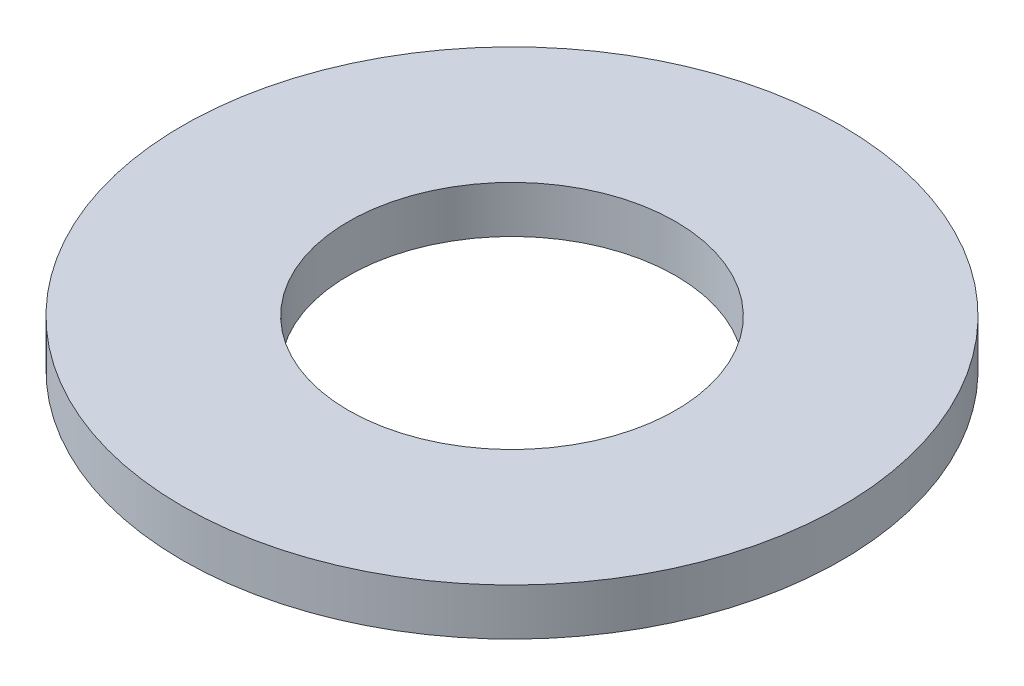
ISO-10303-21;
HEADER;
FILE_DESCRIPTION(('STEP AP214'),'2;1');
FILE_NAME('part.step','',(''),(''),'','','');
FILE_SCHEMA(('AUTOMOTIVE_DESIGN { 1 0 10303 214 1 1 1 1 }'));
ENDSEC;
DATA;
#1=APPLICATION_CONTEXT('core data for automotive mechanical design processes');
#2=APPLICATION_PROTOCOL_DEFINITION('international standard','automotive_design',2000,#1);
#3=PRODUCT_CONTEXT('',#1,'mechanical');
#4=PRODUCT('Part','Part','',(#3));
#5=PRODUCT_RELATED_PRODUCT_CATEGORY('part','',(#4));
#6=PRODUCT_DEFINITION_FORMATION('','',#4);
#7=PRODUCT_DEFINITION_CONTEXT('part definition',#1,'design');
#8=PRODUCT_DEFINITION('design','',#6,#7);
#9=PRODUCT_DEFINITION_SHAPE('','',#8);
#10=(LENGTH_UNIT() NAMED_UNIT(*) SI_UNIT(.MILLI.,.METRE.));
#11=(NAMED_UNIT(*) PLANE_ANGLE_UNIT() SI_UNIT($,.RADIAN.));
#12=(NAMED_UNIT(*) SI_UNIT($,.STERADIAN.) SOLID_ANGLE_UNIT());
#13=UNCERTAINTY_MEASURE_WITH_UNIT(LENGTH_MEASURE(1.E-05),#10,'distance_accuracy_value','');
#14=(GEOMETRIC_REPRESENTATION_CONTEXT(3) GLOBAL_UNCERTAINTY_ASSIGNED_CONTEXT((#13)) GLOBAL_UNIT_ASSIGNED_CONTEXT((#10,
#11,#12)) REPRESENTATION_CONTEXT('',''));
#15=CARTESIAN_POINT('',(0.,0.,0.));
#16=DIRECTION('',(0.,0.,1.));
#17=DIRECTION('',(1.,0.,0.));
#18=AXIS2_PLACEMENT_3D('',#15,#16,#17);
#19=CARTESIAN_POINT('',(0.,1.5,0.));
#20=DIRECTION('',(0.,1.,0.));
#21=DIRECTION('',(0.,0.,1.));
#22=AXIS2_PLACEMENT_3D('',#19,#20,#21);
#23=PLANE('',#22);
#24=CARTESIAN_POINT('',(0.,1.5,0.));
#25=DIRECTION('',(0.,1.,0.));
#26=DIRECTION('',(0.,0.,1.));
#27=AXIS2_PLACEMENT_3D('',#24,#25,#26);
#28=CIRCLE('',#27,10.55);
#29=CARTESIAN_POINT('',(0.,1.5,10.55));
#30=VERTEX_POINT('',#29);
#31=EDGE_CURVE('E10',#30,#30,#28,.T.);
#32=ORIENTED_EDGE('',*,*,#31,.T.);
#33=EDGE_LOOP('',(#32));
#34=FACE_BOUND('',#33,.T.);
#35=CARTESIAN_POINT('',(0.,1.5,0.));
#36=DIRECTION('',(0.,1.,0.));
#37=DIRECTION('',(0.,0.,1.));
#38=AXIS2_PLACEMENT_3D('',#35,#36,#37);
#39=CIRCLE('',#38,5.237300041);
#40=CARTESIAN_POINT('',(0.,1.5,5.237300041));
#41=VERTEX_POINT('',#40);
#42=EDGE_CURVE('E54',#41,#41,#39,.T.);
#43=ORIENTED_EDGE('',*,*,#42,.F.);
#44=EDGE_LOOP('',(#43));
#45=FACE_BOUND('',#44,.T.);
#46=ADVANCED_FACE('F41',(#34,#45),#23,.T.);
#47=CARTESIAN_POINT('',(0.,0.,0.));
#48=DIRECTION('',(0.,1.,0.));
#49=DIRECTION('',(0.,0.,1.));
#50=AXIS2_PLACEMENT_3D('',#47,#48,#49);
#51=PLANE('',#50);
#52=CARTESIAN_POINT('',(0.,0.,0.));
#53=DIRECTION('',(0.,1.,0.));
#54=DIRECTION('',(0.,0.,1.));
#55=AXIS2_PLACEMENT_3D('',#52,#53,#54);
#56=CIRCLE('',#55,10.55);
#57=CARTESIAN_POINT('',(0.,0.,10.55));
#58=VERTEX_POINT('',#57);
#59=EDGE_CURVE('E45',#58,#58,#56,.T.);
#60=ORIENTED_EDGE('',*,*,#59,.F.);
#61=EDGE_LOOP('',(#60));
#62=FACE_BOUND('',#61,.T.);
#63=CARTESIAN_POINT('',(0.,0.,0.));
#64=DIRECTION('',(0.,1.,0.));
#65=DIRECTION('',(0.,0.,1.));
#66=AXIS2_PLACEMENT_3D('',#63,#64,#65);
#67=CIRCLE('',#66,5.237300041);
#68=CARTESIAN_POINT('',(0.,0.,5.237300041));
#69=VERTEX_POINT('',#68);
#70=EDGE_CURVE('E56',#69,#69,#67,.T.);
#71=ORIENTED_EDGE('',*,*,#70,.T.);
#72=EDGE_LOOP('',(#71));
#73=FACE_BOUND('',#72,.T.);
#74=ADVANCED_FACE('F68',(#62,#73),#51,.F.);
#75=CARTESIAN_POINT('',(0.,1.5,0.));
#76=DIRECTION('',(0.,-1.,0.));
#77=DIRECTION('',(0.,0.,-1.));
#78=AXIS2_PLACEMENT_3D('',#75,#76,#77);
#79=CYLINDRICAL_SURFACE('',#78,10.55);
#80=ORIENTED_EDGE('',*,*,#31,.F.);
#81=EDGE_LOOP('',(#80));
#82=FACE_BOUND('',#81,.T.);
#83=ORIENTED_EDGE('',*,*,#59,.T.);
#84=EDGE_LOOP('',(#83));
#85=FACE_BOUND('',#84,.T.);
#86=ADVANCED_FACE('F43',(#82,#85),#79,.T.);
#87=CARTESIAN_POINT('',(0.,1.5,0.));
#88=DIRECTION('',(0.,-1.,0.));
#89=DIRECTION('',(0.,0.,-1.));
#90=AXIS2_PLACEMENT_3D('',#87,#88,#89);
#91=CYLINDRICAL_SURFACE('',#90,5.237300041);
#92=ORIENTED_EDGE('',*,*,#42,.T.);
#93=EDGE_LOOP('',(#92));
#94=FACE_BOUND('',#93,.T.);
#95=ORIENTED_EDGE('',*,*,#70,.F.);
#96=EDGE_LOOP('',(#95));
#97=FACE_BOUND('',#96,.T.);
#98=ADVANCED_FACE('F64',(#94,#97),#91,.F.);
#99=CLOSED_SHELL('',(#46,#74,#86,#98));
#100=MANIFOLD_SOLID_BREP('B2',#99);
#101=ADVANCED_BREP_SHAPE_REPRESENTATION('',(#18,#100),#14);
#102=SHAPE_DEFINITION_REPRESENTATION(#9,#101);
ENDSEC;
END-ISO-10303-21;
